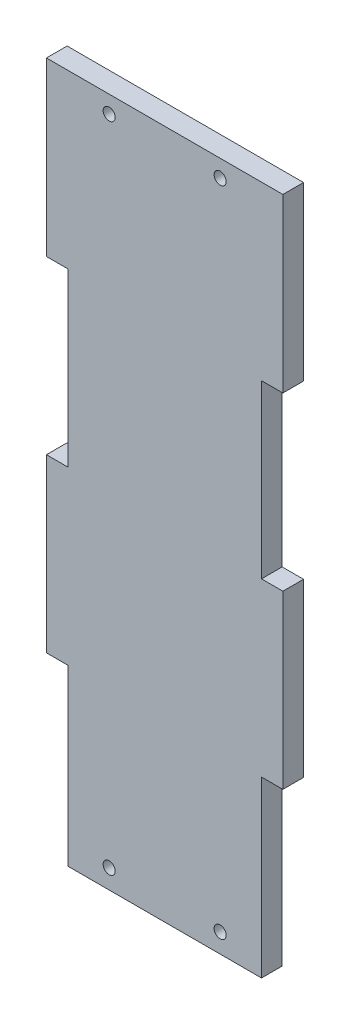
from build123d import *

# Parameters (mm, degrees)
CROQUIS1_R              = 1.75
SALIENTE_EXTRUIR1_DEPTH = 6


with BuildPart() as part:
    # Croquis1 → Saliente-Extruir1 (new body)
    with BuildSketch(Plane.XY):
        Polygon((0, 0), (56.2, 0), (56.2, 50.5), (62.4, 50.5), (62.4, 100.3), (56.2, 100.3), (56.2, 150.1), (62.4, 150.1), (62.4, 200), (56.2, 200), (0, 200), (-6.2, 200), (-6.2, 150.1), (0, 150.1), (0, 100.3), (-6.2, 100.3), (-6.2, 50.5), (0, 50.5), align=None)
        with Locations((12, 195)):
            Circle(CROQUIS1_R, mode=Mode.SUBTRACT)
        with Locations(Location((44.2, 195, 0), (0, 0, 180))):
            Circle(CROQUIS1_R, mode=Mode.SUBTRACT)
        with Locations(Location((12, 5.6, 0), (0, 0, 180))):
            Circle(CROQUIS1_R, mode=Mode.SUBTRACT)
        with Locations((44.2, 5.6)):
            Circle(CROQUIS1_R, mode=Mode.SUBTRACT)
    extrude(amount=SALIENTE_EXTRUIR1_DEPTH)


solid = part.part
